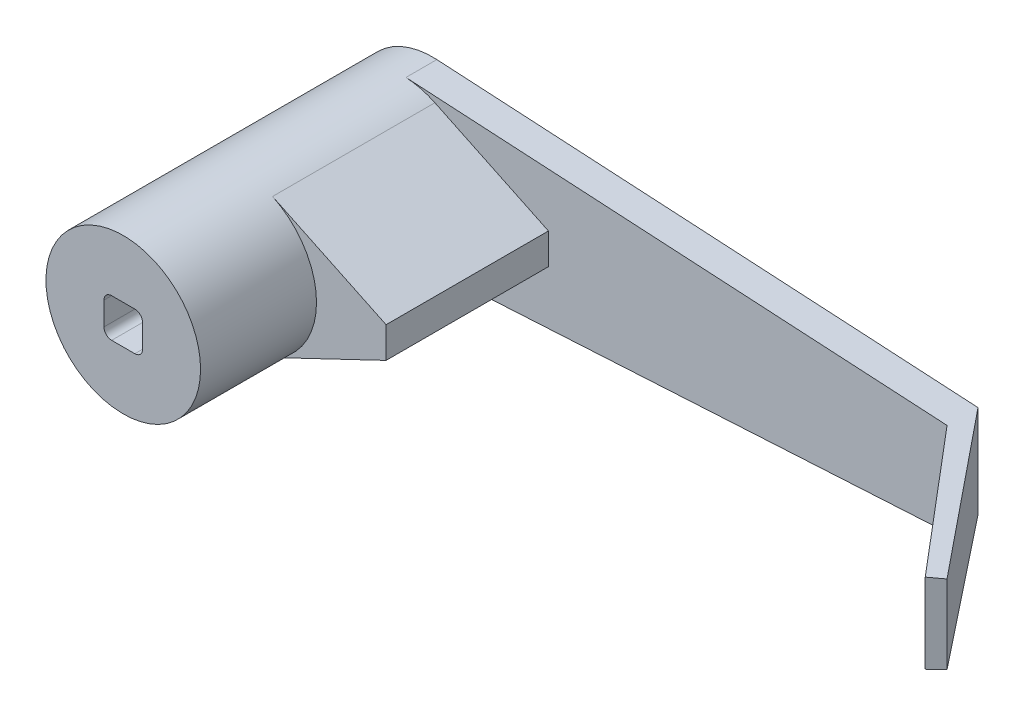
ISO-10303-21;
HEADER;
FILE_DESCRIPTION(('STEP AP214'),'2;1');
FILE_NAME('part.step','',(''),(''),'','','');
FILE_SCHEMA(('AUTOMOTIVE_DESIGN { 1 0 10303 214 1 1 1 1 }'));
ENDSEC;
DATA;
#1=APPLICATION_CONTEXT('core data for automotive mechanical design processes');
#2=APPLICATION_PROTOCOL_DEFINITION('international standard','automotive_design',2000,#1);
#3=PRODUCT_CONTEXT('',#1,'mechanical');
#4=PRODUCT('Part','Part','',(#3));
#5=PRODUCT_RELATED_PRODUCT_CATEGORY('part','',(#4));
#6=PRODUCT_DEFINITION_FORMATION('','',#4);
#7=PRODUCT_DEFINITION_CONTEXT('part definition',#1,'design');
#8=PRODUCT_DEFINITION('design','',#6,#7);
#9=PRODUCT_DEFINITION_SHAPE('','',#8);
#10=(LENGTH_UNIT() NAMED_UNIT(*) SI_UNIT(.MILLI.,.METRE.));
#11=(NAMED_UNIT(*) PLANE_ANGLE_UNIT() SI_UNIT($,.RADIAN.));
#12=(NAMED_UNIT(*) SI_UNIT($,.STERADIAN.) SOLID_ANGLE_UNIT());
#13=UNCERTAINTY_MEASURE_WITH_UNIT(LENGTH_MEASURE(1.E-05),#10,'distance_accuracy_value','');
#14=(GEOMETRIC_REPRESENTATION_CONTEXT(3) GLOBAL_UNCERTAINTY_ASSIGNED_CONTEXT((#13)) GLOBAL_UNIT_ASSIGNED_CONTEXT((#10,
#11,#12)) REPRESENTATION_CONTEXT('',''));
#15=CARTESIAN_POINT('',(0.,0.,0.));
#16=DIRECTION('',(0.,0.,1.));
#17=DIRECTION('',(1.,0.,0.));
#18=AXIS2_PLACEMENT_3D('',#15,#16,#17);
#19=CARTESIAN_POINT('',(0.,0.,50.8));
#20=DIRECTION('',(0.,0.,-1.));
#21=DIRECTION('',(-1.,0.,0.));
#22=AXIS2_PLACEMENT_3D('',#19,#20,#21);
#23=CYLINDRICAL_SURFACE('',#22,12.7);
#24=CARTESIAN_POINT('',(0.,0.,50.8));
#25=DIRECTION('',(0.,0.,1.));
#26=DIRECTION('',(1.,0.,0.));
#27=AXIS2_PLACEMENT_3D('',#24,#25,#26);
#28=CIRCLE('',#27,12.7);
#29=CARTESIAN_POINT('',(12.7,0.,50.8));
#30=VERTEX_POINT('',#29);
#31=EDGE_CURVE('E291',#30,#30,#28,.T.);
#32=ORIENTED_EDGE('',*,*,#31,.F.);
#33=EDGE_LOOP('',(#32));
#34=FACE_BOUND('',#33,.T.);
#35=DIRECTION('',(0.,0.,-1.));
#36=VECTOR('',#35,1.);
#37=CARTESIAN_POINT('',(5.47813138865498,-11.4577518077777,31.75));
#38=LINE('',#37,#36);
#39=CARTESIAN_POINT('',(5.47813138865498,-11.4577518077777,31.75));
#40=VERTEX_POINT('',#39);
#41=CARTESIAN_POINT('',(5.47813138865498,-11.4577518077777,5.08));
#42=VERTEX_POINT('',#41);
#43=EDGE_CURVE('E236',#40,#42,#38,.T.);
#44=ORIENTED_EDGE('',*,*,#43,.F.);
#45=CARTESIAN_POINT('',(0.,0.,31.75));
#46=DIRECTION('',(0.,0.,1.));
#47=DIRECTION('',(1.,0.,0.));
#48=AXIS2_PLACEMENT_3D('',#45,#46,#47);
#49=CIRCLE('',#48,12.7);
#50=CARTESIAN_POINT('',(5.47813138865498,11.4577518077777,31.75));
#51=VERTEX_POINT('',#50);
#52=EDGE_CURVE('E11',#40,#51,#49,.T.);
#53=ORIENTED_EDGE('',*,*,#52,.T.);
#54=DIRECTION('',(0.,0.,-1.));
#55=VECTOR('',#54,1.);
#56=CARTESIAN_POINT('',(5.47813138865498,11.4577518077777,31.75));
#57=LINE('',#56,#55);
#58=CARTESIAN_POINT('',(5.47813138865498,11.4577518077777,5.08));
#59=VERTEX_POINT('',#58);
#60=EDGE_CURVE('E235',#51,#59,#57,.T.);
#61=ORIENTED_EDGE('',*,*,#60,.T.);
#62=CARTESIAN_POINT('',(0.,0.,5.08));
#63=DIRECTION('',(0.,0.,1.));
#64=DIRECTION('',(1.,0.,0.));
#65=AXIS2_PLACEMENT_3D('',#62,#63,#64);
#66=CIRCLE('',#65,12.7);
#67=CARTESIAN_POINT('',(0.721615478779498,12.6794822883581,5.08));
#68=VERTEX_POINT('',#67);
#69=EDGE_CURVE('E294',#59,#68,#66,.T.);
#70=ORIENTED_EDGE('',*,*,#69,.T.);
#71=DIRECTION('',(0.,0.,-1.));
#72=VECTOR('',#71,1.);
#73=CARTESIAN_POINT('',(0.721615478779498,12.6794822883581,5.08));
#74=LINE('',#73,#72);
#75=CARTESIAN_POINT('',(0.721615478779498,12.6794822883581,0.));
#76=VERTEX_POINT('',#75);
#77=EDGE_CURVE('E277',#68,#76,#74,.T.);
#78=ORIENTED_EDGE('',*,*,#77,.T.);
#79=CARTESIAN_POINT('',(0.,0.,0.));
#80=DIRECTION('',(0.,0.,1.));
#81=DIRECTION('',(1.,0.,0.));
#82=AXIS2_PLACEMENT_3D('',#79,#80,#81);
#83=CIRCLE('',#82,12.7);
#84=CARTESIAN_POINT('',(0.721615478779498,-12.6794822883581,0.));
#85=VERTEX_POINT('',#84);
#86=EDGE_CURVE('E290',#76,#85,#83,.T.);
#87=ORIENTED_EDGE('',*,*,#86,.T.);
#88=DIRECTION('',(0.,0.,-1.));
#89=VECTOR('',#88,1.);
#90=CARTESIAN_POINT('',(0.721615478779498,-12.6794822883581,5.08));
#91=LINE('',#90,#89);
#92=CARTESIAN_POINT('',(0.721615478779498,-12.6794822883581,5.08));
#93=VERTEX_POINT('',#92);
#94=EDGE_CURVE('E287',#93,#85,#91,.T.);
#95=ORIENTED_EDGE('',*,*,#94,.F.);
#96=EDGE_CURVE('E296',#93,#42,#66,.T.);
#97=ORIENTED_EDGE('',*,*,#96,.T.);
#98=EDGE_LOOP('',(#44,#53,#61,#70,#78,#87,#95,#97));
#99=FACE_BOUND('',#98,.T.);
#100=ADVANCED_FACE('F33',(#34,#99),#23,.T.);
#101=CARTESIAN_POINT('',(0.,0.,50.8));
#102=DIRECTION('',(0.,0.,1.));
#103=DIRECTION('',(1.,0.,0.));
#104=AXIS2_PLACEMENT_3D('',#101,#102,#103);
#105=PLANE('',#104);
#106=CARTESIAN_POINT('',(-1.905,-1.905,50.8));
#107=DIRECTION('',(0.,0.,1.));
#108=DIRECTION('',(1.,0.,0.));
#109=AXIS2_PLACEMENT_3D('',#106,#107,#108);
#110=CIRCLE('',#109,1.27);
#111=CARTESIAN_POINT('',(-3.175,-1.905,50.8));
#112=VERTEX_POINT('',#111);
#113=CARTESIAN_POINT('',(-1.905,-3.175,50.8));
#114=VERTEX_POINT('',#113);
#115=EDGE_CURVE('E47',#112,#114,#110,.T.);
#116=ORIENTED_EDGE('',*,*,#115,.F.);
#117=DIRECTION('',(0.,-1.,0.));
#118=VECTOR('',#117,1.);
#119=CARTESIAN_POINT('',(-3.175,1.905,50.8));
#120=LINE('',#119,#118);
#121=CARTESIAN_POINT('',(-3.175,1.905,50.8));
#122=VERTEX_POINT('',#121);
#123=EDGE_CURVE('E177',#122,#112,#120,.T.);
#124=ORIENTED_EDGE('',*,*,#123,.F.);
#125=CARTESIAN_POINT('',(-1.905,1.905,50.8));
#126=DIRECTION('',(0.,0.,1.));
#127=DIRECTION('',(1.,0.,0.));
#128=AXIS2_PLACEMENT_3D('',#125,#126,#127);
#129=CIRCLE('',#128,1.27);
#130=CARTESIAN_POINT('',(-1.905,3.175,50.8));
#131=VERTEX_POINT('',#130);
#132=EDGE_CURVE('E180',#131,#122,#129,.T.);
#133=ORIENTED_EDGE('',*,*,#132,.F.);
#134=DIRECTION('',(-1.,0.,0.));
#135=VECTOR('',#134,1.);
#136=CARTESIAN_POINT('',(-1.905,3.175,50.8));
#137=LINE('',#136,#135);
#138=CARTESIAN_POINT('',(1.905,3.175,50.8));
#139=VERTEX_POINT('',#138);
#140=EDGE_CURVE('E208',#139,#131,#137,.T.);
#141=ORIENTED_EDGE('',*,*,#140,.F.);
#142=CARTESIAN_POINT('',(1.905,1.905,50.8));
#143=DIRECTION('',(0.,0.,1.));
#144=DIRECTION('',(-1.,0.,0.));
#145=AXIS2_PLACEMENT_3D('',#142,#143,#144);
#146=CIRCLE('',#145,1.27);
#147=CARTESIAN_POINT('',(3.175,1.905,50.8));
#148=VERTEX_POINT('',#147);
#149=EDGE_CURVE('E205',#148,#139,#146,.T.);
#150=ORIENTED_EDGE('',*,*,#149,.F.);
#151=DIRECTION('',(0.,1.,0.));
#152=VECTOR('',#151,1.);
#153=CARTESIAN_POINT('',(3.175,1.905,50.8));
#154=LINE('',#153,#152);
#155=CARTESIAN_POINT('',(3.175,-1.905,50.8));
#156=VERTEX_POINT('',#155);
#157=EDGE_CURVE('E202',#156,#148,#154,.T.);
#158=ORIENTED_EDGE('',*,*,#157,.F.);
#159=CARTESIAN_POINT('',(1.905,-1.905,50.8));
#160=DIRECTION('',(0.,0.,1.));
#161=DIRECTION('',(1.,0.,0.));
#162=AXIS2_PLACEMENT_3D('',#159,#160,#161);
#163=CIRCLE('',#162,1.27);
#164=CARTESIAN_POINT('',(1.905,-3.175,50.8));
#165=VERTEX_POINT('',#164);
#166=EDGE_CURVE('E199',#165,#156,#163,.T.);
#167=ORIENTED_EDGE('',*,*,#166,.F.);
#168=DIRECTION('',(1.,0.,0.));
#169=VECTOR('',#168,1.);
#170=CARTESIAN_POINT('',(-1.905,-3.175,50.8));
#171=LINE('',#170,#169);
#172=EDGE_CURVE('E197',#114,#165,#171,.T.);
#173=ORIENTED_EDGE('',*,*,#172,.F.);
#174=EDGE_LOOP('',(#116,#124,#133,#141,#150,#158,#167,#173));
#175=FACE_BOUND('',#174,.T.);
#176=ORIENTED_EDGE('',*,*,#31,.T.);
#177=EDGE_LOOP('',(#176));
#178=FACE_BOUND('',#177,.T.);
#179=ADVANCED_FACE('F352',(#175,#178),#105,.T.);
#180=CARTESIAN_POINT('',(0.,0.,0.));
#181=DIRECTION('',(0.,0.,1.));
#182=DIRECTION('',(1.,0.,0.));
#183=AXIS2_PLACEMENT_3D('',#180,#181,#182);
#184=PLANE('',#183);
#185=ORIENTED_EDGE('',*,*,#86,.F.);
#186=DIRECTION('',(-0.998384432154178,0.0568201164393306,0.));
#187=VECTOR('',#186,1.);
#188=CARTESIAN_POINT('',(0.721615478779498,12.6794822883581,0.));
#189=LINE('',#188,#187);
#190=CARTESIAN_POINT('',(89.6216154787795,7.62,0.));
#191=VERTEX_POINT('',#190);
#192=EDGE_CURVE('E272',#191,#76,#189,.T.);
#193=ORIENTED_EDGE('',*,*,#192,.F.);
#194=DIRECTION('',(0.,1.,0.));
#195=VECTOR('',#194,1.);
#196=CARTESIAN_POINT('',(89.6216154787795,7.62,0.));
#197=LINE('',#196,#195);
#198=CARTESIAN_POINT('',(89.6216154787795,-7.62,0.));
#199=VERTEX_POINT('',#198);
#200=EDGE_CURVE('E280',#199,#191,#197,.T.);
#201=ORIENTED_EDGE('',*,*,#200,.F.);
#202=DIRECTION('',(0.998384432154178,0.0568201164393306,0.));
#203=VECTOR('',#202,1.);
#204=CARTESIAN_POINT('',(0.721615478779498,-12.6794822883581,0.));
#205=LINE('',#204,#203);
#206=EDGE_CURVE('E263',#85,#199,#205,.T.);
#207=ORIENTED_EDGE('',*,*,#206,.F.);
#208=EDGE_LOOP('',(#185,#193,#201,#207));
#209=FACE_BOUND('',#208,.T.);
#210=ADVANCED_FACE('F326',(#209),#184,.F.);
#211=CARTESIAN_POINT('',(0.,0.,5.08));
#212=DIRECTION('',(0.,0.,1.));
#213=DIRECTION('',(1.,0.,0.));
#214=AXIS2_PLACEMENT_3D('',#211,#212,#213);
#215=PLANE('',#214);
#216=DIRECTION('',(0.902185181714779,0.43134892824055,0.));
#217=VECTOR('',#216,1.);
#218=CARTESIAN_POINT('',(5.47813138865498,-11.4577518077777,5.08));
#219=LINE('',#218,#217);
#220=CARTESIAN_POINT('',(24.13,-2.54,5.08));
#221=VERTEX_POINT('',#220);
#222=EDGE_CURVE('E40',#42,#221,#219,.T.);
#223=ORIENTED_EDGE('',*,*,#222,.F.);
#224=ORIENTED_EDGE('',*,*,#96,.F.);
#225=DIRECTION('',(0.998384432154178,0.0568201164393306,0.));
#226=VECTOR('',#225,1.);
#227=CARTESIAN_POINT('',(0.721615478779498,-12.6794822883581,5.08));
#228=LINE('',#227,#226);
#229=CARTESIAN_POINT('',(89.6216154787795,-7.62,5.08));
#230=VERTEX_POINT('',#229);
#231=EDGE_CURVE('E269',#93,#230,#228,.T.);
#232=ORIENTED_EDGE('',*,*,#231,.T.);
#233=DIRECTION('',(0.,1.,0.));
#234=VECTOR('',#233,1.);
#235=CARTESIAN_POINT('',(89.6216154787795,7.62,5.08));
#236=LINE('',#235,#234);
#237=CARTESIAN_POINT('',(89.6216154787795,7.62,5.08));
#238=VERTEX_POINT('',#237);
#239=EDGE_CURVE('E271',#230,#238,#236,.T.);
#240=ORIENTED_EDGE('',*,*,#239,.T.);
#241=DIRECTION('',(-0.998384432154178,0.0568201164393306,0.));
#242=VECTOR('',#241,1.);
#243=CARTESIAN_POINT('',(0.721615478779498,12.6794822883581,5.08));
#244=LINE('',#243,#242);
#245=EDGE_CURVE('E274',#238,#68,#244,.T.);
#246=ORIENTED_EDGE('',*,*,#245,.T.);
#247=ORIENTED_EDGE('',*,*,#69,.F.);
#248=DIRECTION('',(-0.902185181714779,0.43134892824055,0.));
#249=VECTOR('',#248,1.);
#250=CARTESIAN_POINT('',(5.47813138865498,11.4577518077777,5.08));
#251=LINE('',#250,#249);
#252=CARTESIAN_POINT('',(24.13,2.54,5.08));
#253=VERTEX_POINT('',#252);
#254=EDGE_CURVE('E299',#253,#59,#251,.T.);
#255=ORIENTED_EDGE('',*,*,#254,.F.);
#256=DIRECTION('',(0.,1.,0.));
#257=VECTOR('',#256,1.);
#258=CARTESIAN_POINT('',(24.13,0.,5.08));
#259=LINE('',#258,#257);
#260=EDGE_CURVE('E302',#221,#253,#259,.T.);
#261=ORIENTED_EDGE('',*,*,#260,.F.);
#262=EDGE_LOOP('',(#223,#224,#232,#240,#246,#247,#255,#261));
#263=FACE_BOUND('',#262,.T.);
#264=ADVANCED_FACE('F320',(#263),#215,.T.);
#265=CARTESIAN_POINT('',(0.721615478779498,-12.6794822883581,5.08));
#266=DIRECTION('',(-0.0568201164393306,0.998384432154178,0.));
#267=DIRECTION('',(-0.998384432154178,-0.0568201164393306,0.));
#268=AXIS2_PLACEMENT_3D('',#265,#266,#267);
#269=PLANE('',#268);
#270=ORIENTED_EDGE('',*,*,#206,.T.);
#271=DIRECTION('',(0.625408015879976,0.0355932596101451,0.779485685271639));
#272=VECTOR('',#271,1.);
#273=CARTESIAN_POINT('',(109.508252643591,-6.48821047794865,24.7859774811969));
#274=LINE('',#273,#272);
#275=CARTESIAN_POINT('',(110.285681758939,-6.44396538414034,25.7549367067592));
#276=VERTEX_POINT('',#275);
#277=EDGE_CURVE('E252',#199,#276,#274,.T.);
#278=ORIENTED_EDGE('',*,*,#277,.T.);
#279=DIRECTION('',(-0.765317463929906,-0.0435557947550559,0.64217760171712));
#280=VECTOR('',#279,1.);
#281=CARTESIAN_POINT('',(107.179448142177,-6.62074754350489,28.3613761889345));
#282=LINE('',#281,#280);
#283=CARTESIAN_POINT('',(108.339928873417,-6.55470219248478,27.3876172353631));
#284=VERTEX_POINT('',#283);
#285=EDGE_CURVE('E249',#276,#284,#282,.T.);
#286=ORIENTED_EDGE('',*,*,#285,.T.);
#287=DIRECTION('',(-0.642357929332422,-0.0365579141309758,-0.765532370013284));
#288=VECTOR('',#287,1.);
#289=CARTESIAN_POINT('',(88.8290924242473,-7.66510412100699,4.1355078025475));
#290=LINE('',#289,#288);
#291=EDGE_CURVE('E239',#284,#230,#290,.T.);
#292=ORIENTED_EDGE('',*,*,#291,.T.);
#293=ORIENTED_EDGE('',*,*,#231,.F.);
#294=ORIENTED_EDGE('',*,*,#94,.T.);
#295=EDGE_LOOP('',(#270,#278,#286,#292,#293,#294));
#296=FACE_BOUND('',#295,.T.);
#297=ADVANCED_FACE('F330',(#296),#269,.F.);
#298=CARTESIAN_POINT('',(0.721615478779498,12.6794822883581,5.08));
#299=DIRECTION('',(-0.0568201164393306,-0.998384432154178,0.));
#300=DIRECTION('',(0.998384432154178,-0.0568201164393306,0.));
#301=AXIS2_PLACEMENT_3D('',#298,#299,#300);
#302=PLANE('',#301);
#303=ORIENTED_EDGE('',*,*,#192,.T.);
#304=ORIENTED_EDGE('',*,*,#77,.F.);
#305=ORIENTED_EDGE('',*,*,#245,.F.);
#306=DIRECTION('',(-0.642357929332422,0.0365579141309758,-0.765532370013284));
#307=VECTOR('',#306,1.);
#308=CARTESIAN_POINT('',(88.8290924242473,7.66510412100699,4.1355078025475));
#309=LINE('',#308,#307);
#310=CARTESIAN_POINT('',(108.339928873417,6.55470219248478,27.3876172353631));
#311=VERTEX_POINT('',#310);
#312=EDGE_CURVE('E256',#311,#238,#309,.T.);
#313=ORIENTED_EDGE('',*,*,#312,.F.);
#314=DIRECTION('',(-0.765317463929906,0.0435557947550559,0.64217760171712));
#315=VECTOR('',#314,1.);
#316=CARTESIAN_POINT('',(107.179448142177,6.62074754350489,28.3613761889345));
#317=LINE('',#316,#315);
#318=CARTESIAN_POINT('',(110.285681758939,6.44396538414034,25.7549367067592));
#319=VERTEX_POINT('',#318);
#320=EDGE_CURVE('E260',#319,#311,#317,.T.);
#321=ORIENTED_EDGE('',*,*,#320,.F.);
#322=DIRECTION('',(0.625408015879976,-0.0355932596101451,0.779485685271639));
#323=VECTOR('',#322,1.);
#324=CARTESIAN_POINT('',(109.508252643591,6.48821047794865,24.7859774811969));
#325=LINE('',#324,#323);
#326=EDGE_CURVE('E259',#191,#319,#325,.T.);
#327=ORIENTED_EDGE('',*,*,#326,.F.);
#328=EDGE_LOOP('',(#303,#304,#305,#313,#321,#327));
#329=FACE_BOUND('',#328,.T.);
#330=ADVANCED_FACE('F323',(#329),#302,.F.);
#331=CARTESIAN_POINT('',(108.339928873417,41.3684170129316,27.3876172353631));
#332=DIRECTION('',(-0.642787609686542,0.,-0.766044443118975));
#333=DIRECTION('',(-0.766044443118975,0.,0.642787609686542));
#334=AXIS2_PLACEMENT_3D('',#331,#332,#333);
#335=PLANE('',#334);
#336=DIRECTION('',(0.,-1.,0.));
#337=VECTOR('',#336,1.);
#338=CARTESIAN_POINT('',(110.285681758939,41.3684170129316,25.7549367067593));
#339=LINE('',#338,#337);
#340=EDGE_CURVE('E255',#319,#276,#339,.T.);
#341=ORIENTED_EDGE('',*,*,#340,.F.);
#342=ORIENTED_EDGE('',*,*,#320,.T.);
#343=DIRECTION('',(0.,-1.,0.));
#344=VECTOR('',#343,1.);
#345=CARTESIAN_POINT('',(108.339928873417,41.3684170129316,27.3876172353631));
#346=LINE('',#345,#344);
#347=EDGE_CURVE('E265',#311,#284,#346,.T.);
#348=ORIENTED_EDGE('',*,*,#347,.T.);
#349=ORIENTED_EDGE('',*,*,#285,.F.);
#350=EDGE_LOOP('',(#341,#342,#348,#349));
#351=FACE_BOUND('',#350,.T.);
#352=ADVANCED_FACE('F341',(#351),#335,.F.);
#353=CARTESIAN_POINT('',(89.6216154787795,41.3684170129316,5.08));
#354=DIRECTION('',(0.766044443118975,0.,-0.642787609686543));
#355=DIRECTION('',(-0.642787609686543,0.,-0.766044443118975));
#356=AXIS2_PLACEMENT_3D('',#353,#354,#355);
#357=PLANE('',#356);
#358=ORIENTED_EDGE('',*,*,#347,.F.);
#359=ORIENTED_EDGE('',*,*,#312,.T.);
#360=ORIENTED_EDGE('',*,*,#239,.F.);
#361=ORIENTED_EDGE('',*,*,#291,.F.);
#362=EDGE_LOOP('',(#358,#359,#360,#361));
#363=FACE_BOUND('',#362,.T.);
#364=ADVANCED_FACE('F335',(#363),#357,.F.);
#365=CARTESIAN_POINT('',(110.285681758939,41.3684170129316,25.7549367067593));
#366=DIRECTION('',(-0.779979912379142,0.,0.625804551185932));
#367=DIRECTION('',(0.625804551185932,0.,0.779979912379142));
#368=AXIS2_PLACEMENT_3D('',#365,#366,#367);
#369=PLANE('',#368);
#370=ORIENTED_EDGE('',*,*,#200,.T.);
#371=ORIENTED_EDGE('',*,*,#326,.T.);
#372=ORIENTED_EDGE('',*,*,#340,.T.);
#373=ORIENTED_EDGE('',*,*,#277,.F.);
#374=EDGE_LOOP('',(#370,#371,#372,#373));
#375=FACE_BOUND('',#374,.T.);
#376=ADVANCED_FACE('F339',(#375),#369,.F.);
#377=CARTESIAN_POINT('',(0.,0.,31.75));
#378=DIRECTION('',(0.,0.,1.));
#379=DIRECTION('',(1.,0.,0.));
#380=AXIS2_PLACEMENT_3D('',#377,#378,#379);
#381=PLANE('',#380);
#382=ORIENTED_EDGE('',*,*,#52,.F.);
#383=DIRECTION('',(-0.902185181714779,-0.43134892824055,0.));
#384=VECTOR('',#383,1.);
#385=CARTESIAN_POINT('',(5.47813138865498,-11.4577518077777,31.75));
#386=LINE('',#385,#384);
#387=CARTESIAN_POINT('',(24.13,-2.54,31.75));
#388=VERTEX_POINT('',#387);
#389=EDGE_CURVE('E232',#388,#40,#386,.T.);
#390=ORIENTED_EDGE('',*,*,#389,.F.);
#391=DIRECTION('',(0.,-1.,0.));
#392=VECTOR('',#391,1.);
#393=CARTESIAN_POINT('',(24.13,2.54,31.75));
#394=LINE('',#393,#392);
#395=CARTESIAN_POINT('',(24.13,2.54,31.75));
#396=VERTEX_POINT('',#395);
#397=EDGE_CURVE('E229',#396,#388,#394,.T.);
#398=ORIENTED_EDGE('',*,*,#397,.F.);
#399=DIRECTION('',(0.902185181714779,-0.43134892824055,0.));
#400=VECTOR('',#399,1.);
#401=CARTESIAN_POINT('',(5.47813138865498,11.4577518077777,31.75));
#402=LINE('',#401,#400);
#403=EDGE_CURVE('E215',#51,#396,#402,.T.);
#404=ORIENTED_EDGE('',*,*,#403,.F.);
#405=EDGE_LOOP('',(#382,#390,#398,#404));
#406=FACE_BOUND('',#405,.T.);
#407=ADVANCED_FACE('F315',(#406),#381,.T.);
#408=CARTESIAN_POINT('',(5.47813138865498,-11.4577518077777,31.75));
#409=DIRECTION('',(0.43134892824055,-0.902185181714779,0.));
#410=DIRECTION('',(0.902185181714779,0.43134892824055,0.));
#411=AXIS2_PLACEMENT_3D('',#408,#409,#410);
#412=PLANE('',#411);
#413=ORIENTED_EDGE('',*,*,#43,.T.);
#414=ORIENTED_EDGE('',*,*,#222,.T.);
#415=DIRECTION('',(0.,0.,-1.));
#416=VECTOR('',#415,1.);
#417=CARTESIAN_POINT('',(24.13,-2.54,31.75));
#418=LINE('',#417,#416);
#419=EDGE_CURVE('E240',#388,#221,#418,.T.);
#420=ORIENTED_EDGE('',*,*,#419,.F.);
#421=ORIENTED_EDGE('',*,*,#389,.T.);
#422=EDGE_LOOP('',(#413,#414,#420,#421));
#423=FACE_BOUND('',#422,.T.);
#424=ADVANCED_FACE('F306',(#423),#412,.T.);
#425=CARTESIAN_POINT('',(24.13,2.54,31.75));
#426=DIRECTION('',(1.,0.,0.));
#427=DIRECTION('',(0.,0.,-1.));
#428=AXIS2_PLACEMENT_3D('',#425,#426,#427);
#429=PLANE('',#428);
#430=ORIENTED_EDGE('',*,*,#419,.T.);
#431=ORIENTED_EDGE('',*,*,#260,.T.);
#432=DIRECTION('',(0.,0.,-1.));
#433=VECTOR('',#432,1.);
#434=CARTESIAN_POINT('',(24.13,2.54,31.75));
#435=LINE('',#434,#433);
#436=EDGE_CURVE('E243',#396,#253,#435,.T.);
#437=ORIENTED_EDGE('',*,*,#436,.F.);
#438=ORIENTED_EDGE('',*,*,#397,.T.);
#439=EDGE_LOOP('',(#430,#431,#437,#438));
#440=FACE_BOUND('',#439,.T.);
#441=ADVANCED_FACE('F310',(#440),#429,.T.);
#442=CARTESIAN_POINT('',(5.47813138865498,11.4577518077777,31.75));
#443=DIRECTION('',(0.43134892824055,0.902185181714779,0.));
#444=DIRECTION('',(-0.902185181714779,0.43134892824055,0.));
#445=AXIS2_PLACEMENT_3D('',#442,#443,#444);
#446=PLANE('',#445);
#447=ORIENTED_EDGE('',*,*,#436,.T.);
#448=ORIENTED_EDGE('',*,*,#254,.T.);
#449=ORIENTED_EDGE('',*,*,#60,.F.);
#450=ORIENTED_EDGE('',*,*,#403,.T.);
#451=EDGE_LOOP('',(#447,#448,#449,#450));
#452=FACE_BOUND('',#451,.T.);
#453=ADVANCED_FACE('F317',(#452),#446,.T.);
#454=CARTESIAN_POINT('',(-1.905,-1.905,25.4));
#455=DIRECTION('',(0.,0.,1.));
#456=DIRECTION('',(1.,0.,0.));
#457=AXIS2_PLACEMENT_3D('',#454,#455,#456);
#458=CYLINDRICAL_SURFACE('',#457,1.27);
#459=ORIENTED_EDGE('',*,*,#115,.T.);
#460=DIRECTION('',(0.,0.,1.));
#461=VECTOR('',#460,1.);
#462=CARTESIAN_POINT('',(-1.905,-3.175,25.4));
#463=LINE('',#462,#461);
#464=CARTESIAN_POINT('',(-1.905,-3.175,25.4));
#465=VERTEX_POINT('',#464);
#466=EDGE_CURVE('E154',#465,#114,#463,.T.);
#467=ORIENTED_EDGE('',*,*,#466,.F.);
#468=CARTESIAN_POINT('',(-1.905,-1.905,25.4));
#469=DIRECTION('',(0.,0.,1.));
#470=DIRECTION('',(1.,0.,0.));
#471=AXIS2_PLACEMENT_3D('',#468,#469,#470);
#472=CIRCLE('',#471,1.27);
#473=CARTESIAN_POINT('',(-3.175,-1.905,25.4));
#474=VERTEX_POINT('',#473);
#475=EDGE_CURVE('E158',#474,#465,#472,.T.);
#476=ORIENTED_EDGE('',*,*,#475,.F.);
#477=DIRECTION('',(0.,0.,1.));
#478=VECTOR('',#477,1.);
#479=CARTESIAN_POINT('',(-3.175,-1.905,25.4));
#480=LINE('',#479,#478);
#481=EDGE_CURVE('E213',#474,#112,#480,.T.);
#482=ORIENTED_EDGE('',*,*,#481,.T.);
#483=EDGE_LOOP('',(#459,#467,#476,#482));
#484=FACE_BOUND('',#483,.T.);
#485=ADVANCED_FACE('F156',(#484),#458,.F.);
#486=CARTESIAN_POINT('',(-3.175,1.905,25.4));
#487=DIRECTION('',(-1.,0.,0.));
#488=DIRECTION('',(0.,0.,1.));
#489=AXIS2_PLACEMENT_3D('',#486,#487,#488);
#490=PLANE('',#489);
#491=ORIENTED_EDGE('',*,*,#123,.T.);
#492=ORIENTED_EDGE('',*,*,#481,.F.);
#493=DIRECTION('',(0.,-1.,0.));
#494=VECTOR('',#493,1.);
#495=CARTESIAN_POINT('',(-3.175,1.905,25.4));
#496=LINE('',#495,#494);
#497=CARTESIAN_POINT('',(-3.175,1.905,25.4));
#498=VERTEX_POINT('',#497);
#499=EDGE_CURVE('E164',#498,#474,#496,.T.);
#500=ORIENTED_EDGE('',*,*,#499,.F.);
#501=DIRECTION('',(0.,0.,1.));
#502=VECTOR('',#501,1.);
#503=CARTESIAN_POINT('',(-3.175,1.905,25.4));
#504=LINE('',#503,#502);
#505=EDGE_CURVE('E216',#498,#122,#504,.T.);
#506=ORIENTED_EDGE('',*,*,#505,.T.);
#507=EDGE_LOOP('',(#491,#492,#500,#506));
#508=FACE_BOUND('',#507,.T.);
#509=ADVANCED_FACE('F386',(#508),#490,.F.);
#510=CARTESIAN_POINT('',(-1.905,1.905,25.4));
#511=DIRECTION('',(0.,0.,1.));
#512=DIRECTION('',(1.,0.,0.));
#513=AXIS2_PLACEMENT_3D('',#510,#511,#512);
#514=CYLINDRICAL_SURFACE('',#513,1.27);
#515=ORIENTED_EDGE('',*,*,#132,.T.);
#516=ORIENTED_EDGE('',*,*,#505,.F.);
#517=CARTESIAN_POINT('',(-1.905,1.905,25.4));
#518=DIRECTION('',(0.,0.,1.));
#519=DIRECTION('',(1.,0.,0.));
#520=AXIS2_PLACEMENT_3D('',#517,#518,#519);
#521=CIRCLE('',#520,1.27);
#522=CARTESIAN_POINT('',(-1.905,3.175,25.4));
#523=VERTEX_POINT('',#522);
#524=EDGE_CURVE('E193',#523,#498,#521,.T.);
#525=ORIENTED_EDGE('',*,*,#524,.F.);
#526=DIRECTION('',(0.,0.,1.));
#527=VECTOR('',#526,1.);
#528=CARTESIAN_POINT('',(-1.905,3.175,25.4));
#529=LINE('',#528,#527);
#530=EDGE_CURVE('E218',#523,#131,#529,.T.);
#531=ORIENTED_EDGE('',*,*,#530,.T.);
#532=EDGE_LOOP('',(#515,#516,#525,#531));
#533=FACE_BOUND('',#532,.T.);
#534=ADVANCED_FACE('F390',(#533),#514,.F.);
#535=CARTESIAN_POINT('',(-1.905,3.175,25.4));
#536=DIRECTION('',(0.,1.,0.));
#537=DIRECTION('',(-1.,0.,0.));
#538=AXIS2_PLACEMENT_3D('',#535,#536,#537);
#539=PLANE('',#538);
#540=ORIENTED_EDGE('',*,*,#140,.T.);
#541=ORIENTED_EDGE('',*,*,#530,.F.);
#542=DIRECTION('',(-1.,0.,0.));
#543=VECTOR('',#542,1.);
#544=CARTESIAN_POINT('',(-1.905,3.175,25.4));
#545=LINE('',#544,#543);
#546=CARTESIAN_POINT('',(1.905,3.175,25.4));
#547=VERTEX_POINT('',#546);
#548=EDGE_CURVE('E190',#547,#523,#545,.T.);
#549=ORIENTED_EDGE('',*,*,#548,.F.);
#550=DIRECTION('',(0.,0.,1.));
#551=VECTOR('',#550,1.);
#552=CARTESIAN_POINT('',(1.905,3.175,25.4));
#553=LINE('',#552,#551);
#554=EDGE_CURVE('E220',#547,#139,#553,.T.);
#555=ORIENTED_EDGE('',*,*,#554,.T.);
#556=EDGE_LOOP('',(#540,#541,#549,#555));
#557=FACE_BOUND('',#556,.T.);
#558=ADVANCED_FACE('F396',(#557),#539,.F.);
#559=CARTESIAN_POINT('',(1.905,1.905,25.4));
#560=DIRECTION('',(0.,0.,1.));
#561=DIRECTION('',(1.,0.,0.));
#562=AXIS2_PLACEMENT_3D('',#559,#560,#561);
#563=CYLINDRICAL_SURFACE('',#562,1.27);
#564=ORIENTED_EDGE('',*,*,#149,.T.);
#565=ORIENTED_EDGE('',*,*,#554,.F.);
#566=CARTESIAN_POINT('',(1.905,1.905,25.4));
#567=DIRECTION('',(0.,0.,1.));
#568=DIRECTION('',(-1.,0.,0.));
#569=AXIS2_PLACEMENT_3D('',#566,#567,#568);
#570=CIRCLE('',#569,1.27);
#571=CARTESIAN_POINT('',(3.175,1.905,25.4));
#572=VERTEX_POINT('',#571);
#573=EDGE_CURVE('E187',#572,#547,#570,.T.);
#574=ORIENTED_EDGE('',*,*,#573,.F.);
#575=DIRECTION('',(0.,0.,1.));
#576=VECTOR('',#575,1.);
#577=CARTESIAN_POINT('',(3.175,1.905,25.4));
#578=LINE('',#577,#576);
#579=EDGE_CURVE('E222',#572,#148,#578,.T.);
#580=ORIENTED_EDGE('',*,*,#579,.T.);
#581=EDGE_LOOP('',(#564,#565,#574,#580));
#582=FACE_BOUND('',#581,.T.);
#583=ADVANCED_FACE('F403',(#582),#563,.F.);
#584=CARTESIAN_POINT('',(3.175,1.905,25.4));
#585=DIRECTION('',(1.,0.,0.));
#586=DIRECTION('',(0.,1.,0.));
#587=AXIS2_PLACEMENT_3D('',#584,#585,#586);
#588=PLANE('',#587);
#589=ORIENTED_EDGE('',*,*,#157,.T.);
#590=ORIENTED_EDGE('',*,*,#579,.F.);
#591=DIRECTION('',(0.,1.,0.));
#592=VECTOR('',#591,1.);
#593=CARTESIAN_POINT('',(3.175,1.905,25.4));
#594=LINE('',#593,#592);
#595=CARTESIAN_POINT('',(3.175,-1.905,25.4));
#596=VERTEX_POINT('',#595);
#597=EDGE_CURVE('E184',#596,#572,#594,.T.);
#598=ORIENTED_EDGE('',*,*,#597,.F.);
#599=DIRECTION('',(0.,0.,1.));
#600=VECTOR('',#599,1.);
#601=CARTESIAN_POINT('',(3.175,-1.905,25.4));
#602=LINE('',#601,#600);
#603=EDGE_CURVE('E224',#596,#156,#602,.T.);
#604=ORIENTED_EDGE('',*,*,#603,.T.);
#605=EDGE_LOOP('',(#589,#590,#598,#604));
#606=FACE_BOUND('',#605,.T.);
#607=ADVANCED_FACE('F407',(#606),#588,.F.);
#608=CARTESIAN_POINT('',(1.905,-1.905,25.4));
#609=DIRECTION('',(0.,0.,1.));
#610=DIRECTION('',(1.,0.,0.));
#611=AXIS2_PLACEMENT_3D('',#608,#609,#610);
#612=CYLINDRICAL_SURFACE('',#611,1.27);
#613=ORIENTED_EDGE('',*,*,#166,.T.);
#614=ORIENTED_EDGE('',*,*,#603,.F.);
#615=CARTESIAN_POINT('',(1.905,-1.905,25.4));
#616=DIRECTION('',(0.,0.,1.));
#617=DIRECTION('',(1.,0.,0.));
#618=AXIS2_PLACEMENT_3D('',#615,#616,#617);
#619=CIRCLE('',#618,1.27);
#620=CARTESIAN_POINT('',(1.905,-3.175,25.4));
#621=VERTEX_POINT('',#620);
#622=EDGE_CURVE('E172',#621,#596,#619,.T.);
#623=ORIENTED_EDGE('',*,*,#622,.F.);
#624=DIRECTION('',(0.,0.,1.));
#625=VECTOR('',#624,1.);
#626=CARTESIAN_POINT('',(1.905,-3.175,25.4));
#627=LINE('',#626,#625);
#628=EDGE_CURVE('E163',#621,#165,#627,.T.);
#629=ORIENTED_EDGE('',*,*,#628,.T.);
#630=EDGE_LOOP('',(#613,#614,#623,#629));
#631=FACE_BOUND('',#630,.T.);
#632=ADVANCED_FACE('F411',(#631),#612,.F.);
#633=CARTESIAN_POINT('',(-1.905,-3.175,25.4));
#634=DIRECTION('',(0.,-1.,0.));
#635=DIRECTION('',(1.,0.,0.));
#636=AXIS2_PLACEMENT_3D('',#633,#634,#635);
#637=PLANE('',#636);
#638=ORIENTED_EDGE('',*,*,#172,.T.);
#639=ORIENTED_EDGE('',*,*,#628,.F.);
#640=DIRECTION('',(1.,0.,0.));
#641=VECTOR('',#640,1.);
#642=CARTESIAN_POINT('',(-1.905,-3.175,25.4));
#643=LINE('',#642,#641);
#644=EDGE_CURVE('E167',#465,#621,#643,.T.);
#645=ORIENTED_EDGE('',*,*,#644,.F.);
#646=ORIENTED_EDGE('',*,*,#466,.T.);
#647=EDGE_LOOP('',(#638,#639,#645,#646));
#648=FACE_BOUND('',#647,.T.);
#649=ADVANCED_FACE('F168',(#648),#637,.F.);
#650=CARTESIAN_POINT('',(-1.905,-1.905,25.4));
#651=DIRECTION('',(0.,0.,1.));
#652=DIRECTION('',(1.,0.,0.));
#653=AXIS2_PLACEMENT_3D('',#650,#651,#652);
#654=PLANE('',#653);
#655=ORIENTED_EDGE('',*,*,#475,.T.);
#656=ORIENTED_EDGE('',*,*,#644,.T.);
#657=ORIENTED_EDGE('',*,*,#622,.T.);
#658=ORIENTED_EDGE('',*,*,#597,.T.);
#659=ORIENTED_EDGE('',*,*,#573,.T.);
#660=ORIENTED_EDGE('',*,*,#548,.T.);
#661=ORIENTED_EDGE('',*,*,#524,.T.);
#662=ORIENTED_EDGE('',*,*,#499,.T.);
#663=EDGE_LOOP('',(#655,#656,#657,#658,#659,#660,#661,#662));
#664=FACE_BOUND('',#663,.T.);
#665=ADVANCED_FACE('F174',(#664),#654,.T.);
#666=CLOSED_SHELL('',(#100,#179,#210,#264,#297,#330,#352,#364,#376,#407,#424,#441,#453,#485,
#509,#534,#558,#583,#607,#632,#649,#665));
#667=MANIFOLD_SOLID_BREP('B2',#666);
#668=ADVANCED_BREP_SHAPE_REPRESENTATION('',(#18,#667),#14);
#669=SHAPE_DEFINITION_REPRESENTATION(#9,#668);
ENDSEC;
END-ISO-10303-21;
